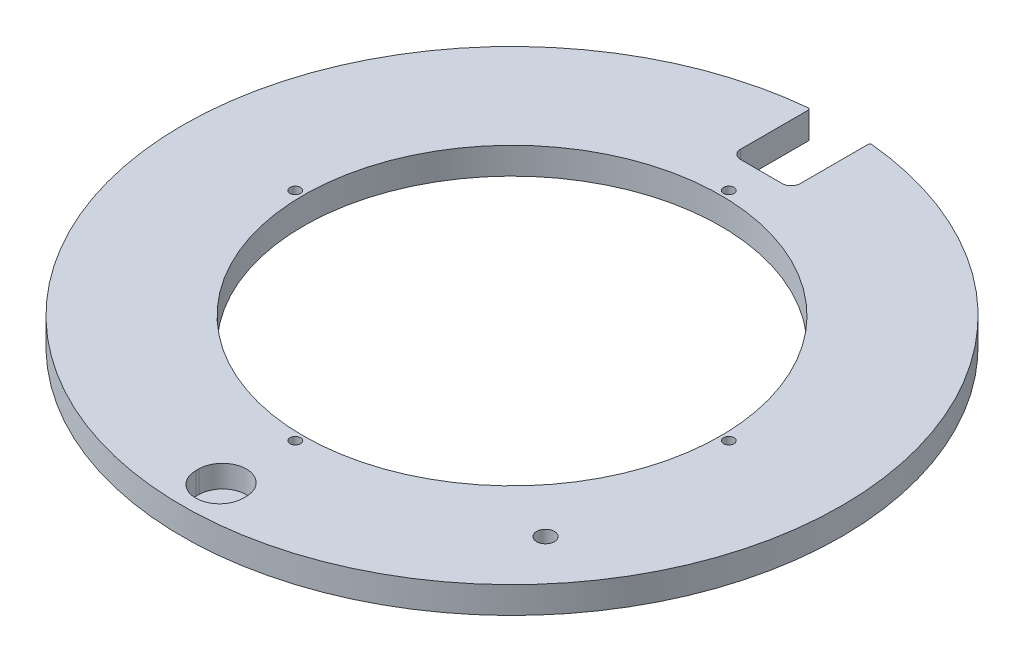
ISO-10303-21;
HEADER;
FILE_DESCRIPTION(('STEP AP214'),'2;1');
FILE_NAME('part.step','',(''),(''),'','','');
FILE_SCHEMA(('AUTOMOTIVE_DESIGN { 1 0 10303 214 1 1 1 1 }'));
ENDSEC;
DATA;
#1=APPLICATION_CONTEXT('core data for automotive mechanical design processes');
#2=APPLICATION_PROTOCOL_DEFINITION('international standard','automotive_design',2000,#1);
#3=PRODUCT_CONTEXT('',#1,'mechanical');
#4=PRODUCT('Part','Part','',(#3));
#5=PRODUCT_RELATED_PRODUCT_CATEGORY('part','',(#4));
#6=PRODUCT_DEFINITION_FORMATION('','',#4);
#7=PRODUCT_DEFINITION_CONTEXT('part definition',#1,'design');
#8=PRODUCT_DEFINITION('design','',#6,#7);
#9=PRODUCT_DEFINITION_SHAPE('','',#8);
#10=(LENGTH_UNIT() NAMED_UNIT(*) SI_UNIT(.MILLI.,.METRE.));
#11=(NAMED_UNIT(*) PLANE_ANGLE_UNIT() SI_UNIT($,.RADIAN.));
#12=(NAMED_UNIT(*) SI_UNIT($,.STERADIAN.) SOLID_ANGLE_UNIT());
#13=UNCERTAINTY_MEASURE_WITH_UNIT(LENGTH_MEASURE(1.E-05),#10,'distance_accuracy_value','');
#14=(GEOMETRIC_REPRESENTATION_CONTEXT(3) GLOBAL_UNCERTAINTY_ASSIGNED_CONTEXT((#13)) GLOBAL_UNIT_ASSIGNED_CONTEXT((#10,
#11,#12)) REPRESENTATION_CONTEXT('',''));
#15=CARTESIAN_POINT('',(0.,0.,0.));
#16=DIRECTION('',(0.,0.,1.));
#17=DIRECTION('',(1.,0.,0.));
#18=AXIS2_PLACEMENT_3D('',#15,#16,#17);
#19=CARTESIAN_POINT('',(0.,1213.64375,0.));
#20=DIRECTION('',(0.,1.,0.));
#21=DIRECTION('',(0.,0.,1.));
#22=AXIS2_PLACEMENT_3D('',#19,#20,#21);
#23=CYLINDRICAL_SURFACE('',#22,176.2125);
#24=CARTESIAN_POINT('',(0.,1204.9125,0.));
#25=DIRECTION('',(0.,1.,0.));
#26=DIRECTION('',(0.,0.,1.));
#27=AXIS2_PLACEMENT_3D('',#24,#25,#26);
#28=CIRCLE('',#27,176.2125);
#29=CARTESIAN_POINT('',(-16.656540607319,1204.9125,-175.423501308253));
#30=VERTEX_POINT('',#29);
#31=CARTESIAN_POINT('',(16.656540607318,1204.9125,-175.423501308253));
#32=VERTEX_POINT('',#31);
#33=EDGE_CURVE('E224',#30,#32,#28,.T.);
#34=ORIENTED_EDGE('',*,*,#33,.T.);
#35=DIRECTION('',(0.,1.,0.));
#36=VECTOR('',#35,1.);
#37=CARTESIAN_POINT('',(16.6565406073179,1213.64375,-175.423501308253));
#38=LINE('',#37,#36);
#39=CARTESIAN_POINT('',(16.6565406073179,1219.2,-175.423501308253));
#40=VERTEX_POINT('',#39);
#41=EDGE_CURVE('E244',#32,#40,#38,.T.);
#42=ORIENTED_EDGE('',*,*,#41,.T.);
#43=CARTESIAN_POINT('',(0.,1219.2,0.));
#44=DIRECTION('',(0.,1.,0.));
#45=DIRECTION('',(0.,0.,1.));
#46=AXIS2_PLACEMENT_3D('',#43,#44,#45);
#47=CIRCLE('',#46,176.2125);
#48=CARTESIAN_POINT('',(-16.6565406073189,1219.2,-175.423501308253));
#49=VERTEX_POINT('',#48);
#50=EDGE_CURVE('E230',#49,#40,#47,.T.);
#51=ORIENTED_EDGE('',*,*,#50,.F.);
#52=DIRECTION('',(0.,1.,0.));
#53=VECTOR('',#52,1.);
#54=CARTESIAN_POINT('',(-16.656540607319,1213.64375,-175.423501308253));
#55=LINE('',#54,#53);
#56=EDGE_CURVE('E241',#49,#30,#55,.F.);
#57=ORIENTED_EDGE('',*,*,#56,.T.);
#58=EDGE_LOOP('',(#34,#42,#51,#57));
#59=FACE_BOUND('',#58,.T.);
#60=ADVANCED_FACE('F32',(#59),#23,.T.);
#61=CARTESIAN_POINT('',(0.,1219.2,0.));
#62=DIRECTION('',(0.,1.,0.));
#63=DIRECTION('',(0.,0.,1.));
#64=AXIS2_PLACEMENT_3D('',#61,#62,#63);
#65=PLANE('',#64);
#66=CARTESIAN_POINT('',(0.,1219.2,0.));
#67=DIRECTION('',(0.,1.,0.));
#68=DIRECTION('',(0.,0.,1.));
#69=AXIS2_PLACEMENT_3D('',#66,#67,#68);
#70=CIRCLE('',#69,111.521875);
#71=CARTESIAN_POINT('',(0.,1219.2,111.521875));
#72=VERTEX_POINT('',#71);
#73=EDGE_CURVE('E227',#72,#72,#70,.T.);
#74=ORIENTED_EDGE('',*,*,#73,.F.);
#75=EDGE_LOOP('',(#74));
#76=FACE_BOUND('',#75,.T.);
#77=CARTESIAN_POINT('',(-5.40415845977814E-13,1219.2,154.78125));
#78=DIRECTION('',(0.,1.,0.));
#79=DIRECTION('',(0.,0.,1.));
#80=AXIS2_PLACEMENT_3D('',#77,#78,#79);
#81=CIRCLE('',#80,12.71905);
#82=CARTESIAN_POINT('',(12.7190499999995,1219.2,154.78125));
#83=VERTEX_POINT('',#82);
#84=CARTESIAN_POINT('',(-12.7190500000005,1219.2,154.78125));
#85=VERTEX_POINT('',#84);
#86=EDGE_CURVE('E189',#83,#85,#81,.T.);
#87=ORIENTED_EDGE('',*,*,#86,.F.);
#88=DIRECTION('',(0.,0.,-1.));
#89=VECTOR('',#88,1.);
#90=CARTESIAN_POINT('',(12.7190499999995,1219.2,154.78125));
#91=LINE('',#90,#89);
#92=CARTESIAN_POINT('',(12.7190499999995,1219.2,156.36875));
#93=VERTEX_POINT('',#92);
#94=EDGE_CURVE('E194',#93,#83,#91,.T.);
#95=ORIENTED_EDGE('',*,*,#94,.F.);
#96=CARTESIAN_POINT('',(-5.45958572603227E-13,1219.2,156.36875));
#97=DIRECTION('',(0.,1.,0.));
#98=DIRECTION('',(0.,0.,1.));
#99=AXIS2_PLACEMENT_3D('',#96,#97,#98);
#100=CIRCLE('',#99,12.71905);
#101=CARTESIAN_POINT('',(-12.7190500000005,1219.2,156.36875));
#102=VERTEX_POINT('',#101);
#103=EDGE_CURVE('E208',#102,#93,#100,.T.);
#104=ORIENTED_EDGE('',*,*,#103,.F.);
#105=DIRECTION('',(0.,0.,1.));
#106=VECTOR('',#105,1.);
#107=CARTESIAN_POINT('',(-12.7190500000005,1219.2,154.78125));
#108=LINE('',#107,#106);
#109=EDGE_CURVE('E205',#85,#102,#108,.T.);
#110=ORIENTED_EDGE('',*,*,#109,.F.);
#111=EDGE_LOOP('',(#87,#95,#104,#110));
#112=FACE_BOUND('',#111,.T.);
#113=CARTESIAN_POINT('',(115.8875,1219.20000000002,0.));
#114=DIRECTION('',(0.,1.,0.));
#115=DIRECTION('',(0.,0.,1.));
#116=AXIS2_PLACEMENT_3D('',#113,#114,#115);
#117=CIRCLE('',#116,2.80670000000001);
#118=CARTESIAN_POINT('',(115.8875,1219.20000000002,2.80670000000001));
#119=VERTEX_POINT('',#118);
#120=EDGE_CURVE('E183',#119,#119,#117,.T.);
#121=ORIENTED_EDGE('',*,*,#120,.F.);
#122=EDGE_LOOP('',(#121));
#123=FACE_BOUND('',#122,.T.);
#124=CARTESIAN_POINT('',(0.,1219.20000000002,115.8875));
#125=DIRECTION('',(0.,1.,0.));
#126=DIRECTION('',(0.,0.,1.));
#127=AXIS2_PLACEMENT_3D('',#124,#125,#126);
#128=CIRCLE('',#127,2.80670000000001);
#129=CARTESIAN_POINT('',(0.,1219.20000000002,118.6942));
#130=VERTEX_POINT('',#129);
#131=EDGE_CURVE('E177',#130,#130,#128,.T.);
#132=ORIENTED_EDGE('',*,*,#131,.F.);
#133=EDGE_LOOP('',(#132));
#134=FACE_BOUND('',#133,.T.);
#135=CARTESIAN_POINT('',(-115.8875,1219.20000000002,0.));
#136=DIRECTION('',(0.,1.,0.));
#137=DIRECTION('',(0.,0.,1.));
#138=AXIS2_PLACEMENT_3D('',#135,#136,#137);
#139=CIRCLE('',#138,2.80670000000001);
#140=CARTESIAN_POINT('',(-115.8875,1219.20000000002,2.80670000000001));
#141=VERTEX_POINT('',#140);
#142=EDGE_CURVE('E171',#141,#141,#139,.T.);
#143=ORIENTED_EDGE('',*,*,#142,.F.);
#144=EDGE_LOOP('',(#143));
#145=FACE_BOUND('',#144,.T.);
#146=CARTESIAN_POINT('',(0.,1219.20000000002,-115.8875));
#147=DIRECTION('',(0.,1.,0.));
#148=DIRECTION('',(0.,0.,1.));
#149=AXIS2_PLACEMENT_3D('',#146,#147,#148);
#150=CIRCLE('',#149,2.80670000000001);
#151=CARTESIAN_POINT('',(0.,1219.20000000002,-113.0808));
#152=VERTEX_POINT('',#151);
#153=EDGE_CURVE('E165',#152,#152,#150,.T.);
#154=ORIENTED_EDGE('',*,*,#153,.F.);
#155=EDGE_LOOP('',(#154));
#156=FACE_BOUND('',#155,.T.);
#157=CARTESIAN_POINT('',(111.272743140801,1219.2,93.3689177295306));
#158=DIRECTION('',(0.,1.,0.));
#159=DIRECTION('',(0.,0.,1.));
#160=AXIS2_PLACEMENT_3D('',#157,#158,#159);
#161=CIRCLE('',#160,4.76885000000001);
#162=CARTESIAN_POINT('',(111.272743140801,1219.2,98.1377677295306));
#163=VERTEX_POINT('',#162);
#164=EDGE_CURVE('E162',#163,#163,#161,.T.);
#165=ORIENTED_EDGE('',*,*,#164,.F.);
#166=EDGE_LOOP('',(#165));
#167=FACE_BOUND('',#166,.T.);
#168=ORIENTED_EDGE('',*,*,#50,.T.);
#169=DIRECTION('',(0.708710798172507,0.,-0.705499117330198));
#170=VECTOR('',#169,1.);
#171=CARTESIAN_POINT('',(-79.4204025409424,1219.2,-79.7819522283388));
#172=LINE('',#171,#170);
#173=CARTESIAN_POINT('',(15.9257999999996,1219.20000000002,-174.696072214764));
#174=VERTEX_POINT('',#173);
#175=EDGE_CURVE('E249',#40,#174,#172,.F.);
#176=ORIENTED_EDGE('',*,*,#175,.T.);
#177=DIRECTION('',(0.,0.,-1.));
#178=VECTOR('',#177,1.);
#179=CARTESIAN_POINT('',(15.9257999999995,1219.20000000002,-184.15));
#180=LINE('',#179,#178);
#181=CARTESIAN_POINT('',(15.9258,1219.20000000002,-138.1125));
#182=VERTEX_POINT('',#181);
#183=EDGE_CURVE('E151',#182,#174,#180,.T.);
#184=ORIENTED_EDGE('',*,*,#183,.F.);
#185=CARTESIAN_POINT('',(11.1633,1219.20000000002,-138.1125));
#186=DIRECTION('',(0.,1.,0.));
#187=DIRECTION('',(0.,0.,-1.));
#188=AXIS2_PLACEMENT_3D('',#185,#186,#187);
#189=CIRCLE('',#188,4.7625);
#190=CARTESIAN_POINT('',(11.1633,1219.20000000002,-133.35));
#191=VERTEX_POINT('',#190);
#192=EDGE_CURVE('E147',#191,#182,#189,.T.);
#193=ORIENTED_EDGE('',*,*,#192,.F.);
#194=DIRECTION('',(1.,0.,0.));
#195=VECTOR('',#194,1.);
#196=CARTESIAN_POINT('',(-11.1633000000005,1219.20000000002,-133.35));
#197=LINE('',#196,#195);
#198=CARTESIAN_POINT('',(-11.1633000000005,1219.20000000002,-133.35));
#199=VERTEX_POINT('',#198);
#200=EDGE_CURVE('E145',#199,#191,#197,.T.);
#201=ORIENTED_EDGE('',*,*,#200,.F.);
#202=CARTESIAN_POINT('',(-11.1633,1219.20000000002,-138.1125));
#203=DIRECTION('',(0.,1.,0.));
#204=DIRECTION('',(0.,0.,-1.));
#205=AXIS2_PLACEMENT_3D('',#202,#203,#204);
#206=CIRCLE('',#205,4.76250000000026);
#207=CARTESIAN_POINT('',(-15.9258000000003,1219.20000000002,-138.1125));
#208=VERTEX_POINT('',#207);
#209=EDGE_CURVE('E130',#208,#199,#206,.T.);
#210=ORIENTED_EDGE('',*,*,#209,.F.);
#211=DIRECTION('',(0.,0.,1.));
#212=VECTOR('',#211,1.);
#213=CARTESIAN_POINT('',(-15.9258000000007,1219.20000000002,-184.15));
#214=LINE('',#213,#212);
#215=CARTESIAN_POINT('',(-15.9258000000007,1219.20000000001,-174.696072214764));
#216=VERTEX_POINT('',#215);
#217=EDGE_CURVE('E122',#216,#208,#214,.T.);
#218=ORIENTED_EDGE('',*,*,#217,.F.);
#219=DIRECTION('',(-0.708710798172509,0.,-0.705499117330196));
#220=VECTOR('',#219,1.);
#221=CARTESIAN_POINT('',(79.4204025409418,1219.2,-79.7819522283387));
#222=LINE('',#221,#220);
#223=EDGE_CURVE('E247',#216,#49,#222,.T.);
#224=ORIENTED_EDGE('',*,*,#223,.T.);
#225=EDGE_LOOP('',(#168,#176,#184,#193,#201,#210,#218,#224));
#226=FACE_BOUND('',#225,.T.);
#227=ADVANCED_FACE('F143',(#76,#112,#123,#134,#145,#156,#167,#226),#65,.T.);
#228=CARTESIAN_POINT('',(0.,1204.9125,0.));
#229=DIRECTION('',(0.,1.,0.));
#230=DIRECTION('',(0.,0.,1.));
#231=AXIS2_PLACEMENT_3D('',#228,#229,#230);
#232=PLANE('',#231);
#233=CARTESIAN_POINT('',(0.,1204.9125,0.));
#234=DIRECTION('',(0.,1.,0.));
#235=DIRECTION('',(0.,0.,1.));
#236=AXIS2_PLACEMENT_3D('',#233,#234,#235);
#237=CIRCLE('',#236,111.521875);
#238=CARTESIAN_POINT('',(0.,1204.9125,111.521875));
#239=VERTEX_POINT('',#238);
#240=EDGE_CURVE('E215',#239,#239,#237,.T.);
#241=ORIENTED_EDGE('',*,*,#240,.T.);
#242=EDGE_LOOP('',(#241));
#243=FACE_BOUND('',#242,.T.);
#244=CARTESIAN_POINT('',(115.8875,1204.9125,0.));
#245=DIRECTION('',(0.,1.,0.));
#246=DIRECTION('',(0.,0.,1.));
#247=AXIS2_PLACEMENT_3D('',#244,#245,#246);
#248=CIRCLE('',#247,2.8067);
#249=CARTESIAN_POINT('',(115.8875,1204.9125,2.80670000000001));
#250=VERTEX_POINT('',#249);
#251=EDGE_CURVE('E186',#250,#250,#248,.T.);
#252=ORIENTED_EDGE('',*,*,#251,.T.);
#253=EDGE_LOOP('',(#252));
#254=FACE_BOUND('',#253,.T.);
#255=CARTESIAN_POINT('',(0.,1204.9125,115.8875));
#256=DIRECTION('',(0.,1.,0.));
#257=DIRECTION('',(0.,0.,1.));
#258=AXIS2_PLACEMENT_3D('',#255,#256,#257);
#259=CIRCLE('',#258,2.8067);
#260=CARTESIAN_POINT('',(0.,1204.9125,118.6942));
#261=VERTEX_POINT('',#260);
#262=EDGE_CURVE('E180',#261,#261,#259,.T.);
#263=ORIENTED_EDGE('',*,*,#262,.T.);
#264=EDGE_LOOP('',(#263));
#265=FACE_BOUND('',#264,.T.);
#266=CARTESIAN_POINT('',(-115.8875,1204.9125,0.));
#267=DIRECTION('',(0.,1.,0.));
#268=DIRECTION('',(0.,0.,1.));
#269=AXIS2_PLACEMENT_3D('',#266,#267,#268);
#270=CIRCLE('',#269,2.8067);
#271=CARTESIAN_POINT('',(-115.8875,1204.9125,2.8067));
#272=VERTEX_POINT('',#271);
#273=EDGE_CURVE('E174',#272,#272,#270,.T.);
#274=ORIENTED_EDGE('',*,*,#273,.T.);
#275=EDGE_LOOP('',(#274));
#276=FACE_BOUND('',#275,.T.);
#277=CARTESIAN_POINT('',(0.,1204.9125,-115.8875));
#278=DIRECTION('',(0.,1.,0.));
#279=DIRECTION('',(0.,0.,1.));
#280=AXIS2_PLACEMENT_3D('',#277,#278,#279);
#281=CIRCLE('',#280,2.8067);
#282=CARTESIAN_POINT('',(0.,1204.9125,-113.0808));
#283=VERTEX_POINT('',#282);
#284=EDGE_CURVE('E168',#283,#283,#281,.T.);
#285=ORIENTED_EDGE('',*,*,#284,.T.);
#286=EDGE_LOOP('',(#285));
#287=FACE_BOUND('',#286,.T.);
#288=CARTESIAN_POINT('',(111.272743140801,1204.91249999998,93.3689177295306));
#289=DIRECTION('',(0.,-1.,0.));
#290=DIRECTION('',(0.,0.,-1.));
#291=AXIS2_PLACEMENT_3D('',#288,#289,#290);
#292=CIRCLE('',#291,4.76885000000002);
#293=CARTESIAN_POINT('',(111.272743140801,1204.91249999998,88.6000677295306));
#294=VERTEX_POINT('',#293);
#295=EDGE_CURVE('E138',#294,#294,#292,.T.);
#296=ORIENTED_EDGE('',*,*,#295,.F.);
#297=EDGE_LOOP('',(#296));
#298=FACE_BOUND('',#297,.T.);
#299=DIRECTION('',(0.,0.,1.));
#300=VECTOR('',#299,1.);
#301=CARTESIAN_POINT('',(15.9258000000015,1204.9125,-1.69226701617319E-13));
#302=LINE('',#301,#300);
#303=CARTESIAN_POINT('',(15.9257999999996,1204.9125,-174.696072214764));
#304=VERTEX_POINT('',#303);
#305=CARTESIAN_POINT('',(15.9258,1204.9125,-138.1125));
#306=VERTEX_POINT('',#305);
#307=EDGE_CURVE('E232',#304,#306,#302,.T.);
#308=ORIENTED_EDGE('',*,*,#307,.F.);
#309=DIRECTION('',(-0.708710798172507,0.,0.705499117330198));
#310=VECTOR('',#309,1.);
#311=CARTESIAN_POINT('',(16.6565406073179,1204.9125,-175.423501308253));
#312=LINE('',#311,#310);
#313=EDGE_CURVE('E40',#304,#32,#312,.F.);
#314=ORIENTED_EDGE('',*,*,#313,.T.);
#315=ORIENTED_EDGE('',*,*,#33,.F.);
#316=DIRECTION('',(0.708710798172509,0.,0.705499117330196));
#317=VECTOR('',#316,1.);
#318=CARTESIAN_POINT('',(-16.656540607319,1204.9125,-175.423501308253));
#319=LINE('',#318,#317);
#320=CARTESIAN_POINT('',(-15.9258000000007,1204.9125,-174.696072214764));
#321=VERTEX_POINT('',#320);
#322=EDGE_CURVE('E47',#30,#321,#319,.T.);
#323=ORIENTED_EDGE('',*,*,#322,.T.);
#324=DIRECTION('',(0.,0.,-1.));
#325=VECTOR('',#324,1.);
#326=CARTESIAN_POINT('',(-15.9258,1204.9125,0.));
#327=LINE('',#326,#325);
#328=CARTESIAN_POINT('',(-15.9258000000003,1204.9125,-138.1125));
#329=VERTEX_POINT('',#328);
#330=EDGE_CURVE('E239',#329,#321,#327,.T.);
#331=ORIENTED_EDGE('',*,*,#330,.F.);
#332=CARTESIAN_POINT('',(-11.1633,1204.9125,-138.1125));
#333=DIRECTION('',(0.,1.,0.));
#334=DIRECTION('',(0.,0.,1.));
#335=AXIS2_PLACEMENT_3D('',#332,#333,#334);
#336=CIRCLE('',#335,4.76250000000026);
#337=CARTESIAN_POINT('',(-11.1633000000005,1204.9125,-133.35));
#338=VERTEX_POINT('',#337);
#339=EDGE_CURVE('E137',#338,#329,#336,.F.);
#340=ORIENTED_EDGE('',*,*,#339,.F.);
#341=DIRECTION('',(-1.,0.,0.));
#342=VECTOR('',#341,1.);
#343=CARTESIAN_POINT('',(0.,1204.9125,-133.35));
#344=LINE('',#343,#342);
#345=CARTESIAN_POINT('',(11.1633,1204.9125,-133.35));
#346=VERTEX_POINT('',#345);
#347=EDGE_CURVE('E236',#346,#338,#344,.T.);
#348=ORIENTED_EDGE('',*,*,#347,.F.);
#349=CARTESIAN_POINT('',(11.1633,1204.9125,-138.1125));
#350=DIRECTION('',(0.,1.,0.));
#351=DIRECTION('',(0.,0.,1.));
#352=AXIS2_PLACEMENT_3D('',#349,#350,#351);
#353=CIRCLE('',#352,4.7625);
#354=EDGE_CURVE('E234',#306,#346,#353,.F.);
#355=ORIENTED_EDGE('',*,*,#354,.F.);
#356=EDGE_LOOP('',(#308,#314,#315,#323,#331,#340,#348,#355));
#357=FACE_BOUND('',#356,.T.);
#358=ADVANCED_FACE('F253',(#243,#254,#265,#276,#287,#298,#357),#232,.F.);
#359=CARTESIAN_POINT('',(0.,1213.64375,0.));
#360=DIRECTION('',(0.,1.,0.));
#361=DIRECTION('',(0.,0.,1.));
#362=AXIS2_PLACEMENT_3D('',#359,#360,#361);
#363=CYLINDRICAL_SURFACE('',#362,111.521875);
#364=ORIENTED_EDGE('',*,*,#73,.T.);
#365=EDGE_LOOP('',(#364));
#366=FACE_BOUND('',#365,.T.);
#367=ORIENTED_EDGE('',*,*,#240,.F.);
#368=EDGE_LOOP('',(#367));
#369=FACE_BOUND('',#368,.T.);
#370=ADVANCED_FACE('F339',(#366,#369),#363,.F.);
#371=CARTESIAN_POINT('',(-5.40415845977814E-13,1207.29375,154.78125));
#372=DIRECTION('',(0.,1.,0.));
#373=DIRECTION('',(0.,0.,1.));
#374=AXIS2_PLACEMENT_3D('',#371,#372,#373);
#375=CYLINDRICAL_SURFACE('',#374,12.71905);
#376=ORIENTED_EDGE('',*,*,#86,.T.);
#377=DIRECTION('',(0.,1.,0.));
#378=VECTOR('',#377,1.);
#379=CARTESIAN_POINT('',(-12.7190500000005,1207.29375,154.78125));
#380=LINE('',#379,#378);
#381=CARTESIAN_POINT('',(-12.7190500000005,1207.29375,154.78125));
#382=VERTEX_POINT('',#381);
#383=EDGE_CURVE('E203',#382,#85,#380,.T.);
#384=ORIENTED_EDGE('',*,*,#383,.F.);
#385=CARTESIAN_POINT('',(-5.40415845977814E-13,1207.29375,154.78125));
#386=DIRECTION('',(0.,1.,0.));
#387=DIRECTION('',(0.,0.,1.));
#388=AXIS2_PLACEMENT_3D('',#385,#386,#387);
#389=CIRCLE('',#388,12.71905);
#390=CARTESIAN_POINT('',(12.7190499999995,1207.29375,154.78125));
#391=VERTEX_POINT('',#390);
#392=EDGE_CURVE('E190',#391,#382,#389,.T.);
#393=ORIENTED_EDGE('',*,*,#392,.F.);
#394=DIRECTION('',(0.,1.,0.));
#395=VECTOR('',#394,1.);
#396=CARTESIAN_POINT('',(12.7190499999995,1207.29375,154.78125));
#397=LINE('',#396,#395);
#398=EDGE_CURVE('E213',#391,#83,#397,.T.);
#399=ORIENTED_EDGE('',*,*,#398,.T.);
#400=EDGE_LOOP('',(#376,#384,#393,#399));
#401=FACE_BOUND('',#400,.T.);
#402=ADVANCED_FACE('F329',(#401),#375,.F.);
#403=CARTESIAN_POINT('',(12.7190499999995,1207.29375,154.78125));
#404=DIRECTION('',(1.,0.,0.));
#405=DIRECTION('',(0.,0.,-1.));
#406=AXIS2_PLACEMENT_3D('',#403,#404,#405);
#407=PLANE('',#406);
#408=ORIENTED_EDGE('',*,*,#94,.T.);
#409=ORIENTED_EDGE('',*,*,#398,.F.);
#410=DIRECTION('',(0.,0.,-1.));
#411=VECTOR('',#410,1.);
#412=CARTESIAN_POINT('',(12.7190499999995,1207.29375,154.78125));
#413=LINE('',#412,#411);
#414=CARTESIAN_POINT('',(12.7190499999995,1207.29375,156.36875));
#415=VERTEX_POINT('',#414);
#416=EDGE_CURVE('E200',#415,#391,#413,.T.);
#417=ORIENTED_EDGE('',*,*,#416,.F.);
#418=DIRECTION('',(0.,1.,0.));
#419=VECTOR('',#418,1.);
#420=CARTESIAN_POINT('',(12.7190499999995,1207.29375,156.36875));
#421=LINE('',#420,#419);
#422=EDGE_CURVE('E216',#415,#93,#421,.T.);
#423=ORIENTED_EDGE('',*,*,#422,.T.);
#424=EDGE_LOOP('',(#408,#409,#417,#423));
#425=FACE_BOUND('',#424,.T.);
#426=ADVANCED_FACE('F325',(#425),#407,.F.);
#427=CARTESIAN_POINT('',(-5.45958572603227E-13,1207.29375,156.36875));
#428=DIRECTION('',(0.,1.,0.));
#429=DIRECTION('',(0.,0.,1.));
#430=AXIS2_PLACEMENT_3D('',#427,#428,#429);
#431=CYLINDRICAL_SURFACE('',#430,12.71905);
#432=ORIENTED_EDGE('',*,*,#103,.T.);
#433=ORIENTED_EDGE('',*,*,#422,.F.);
#434=CARTESIAN_POINT('',(-5.45958572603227E-13,1207.29375,156.36875));
#435=DIRECTION('',(0.,1.,0.));
#436=DIRECTION('',(0.,0.,1.));
#437=AXIS2_PLACEMENT_3D('',#434,#435,#436);
#438=CIRCLE('',#437,12.71905);
#439=CARTESIAN_POINT('',(-12.7190500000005,1207.29375,156.36875));
#440=VERTEX_POINT('',#439);
#441=EDGE_CURVE('E197',#440,#415,#438,.T.);
#442=ORIENTED_EDGE('',*,*,#441,.F.);
#443=DIRECTION('',(0.,1.,0.));
#444=VECTOR('',#443,1.);
#445=CARTESIAN_POINT('',(-12.7190500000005,1207.29375,156.36875));
#446=LINE('',#445,#444);
#447=EDGE_CURVE('E218',#440,#102,#446,.T.);
#448=ORIENTED_EDGE('',*,*,#447,.T.);
#449=EDGE_LOOP('',(#432,#433,#442,#448));
#450=FACE_BOUND('',#449,.T.);
#451=ADVANCED_FACE('F328',(#450),#431,.F.);
#452=CARTESIAN_POINT('',(-12.7190500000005,1207.29375,154.78125));
#453=DIRECTION('',(-1.,0.,0.));
#454=DIRECTION('',(0.,0.,1.));
#455=AXIS2_PLACEMENT_3D('',#452,#453,#454);
#456=PLANE('',#455);
#457=ORIENTED_EDGE('',*,*,#109,.T.);
#458=ORIENTED_EDGE('',*,*,#447,.F.);
#459=DIRECTION('',(0.,0.,1.));
#460=VECTOR('',#459,1.);
#461=CARTESIAN_POINT('',(-12.7190500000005,1207.29375,154.78125));
#462=LINE('',#461,#460);
#463=EDGE_CURVE('E193',#382,#440,#462,.T.);
#464=ORIENTED_EDGE('',*,*,#463,.F.);
#465=ORIENTED_EDGE('',*,*,#383,.T.);
#466=EDGE_LOOP('',(#457,#458,#464,#465));
#467=FACE_BOUND('',#466,.T.);
#468=ADVANCED_FACE('F323',(#467),#456,.F.);
#469=CARTESIAN_POINT('',(-5.40415845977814E-13,1207.29375,154.78125));
#470=DIRECTION('',(0.,1.,0.));
#471=DIRECTION('',(0.,0.,1.));
#472=AXIS2_PLACEMENT_3D('',#469,#470,#471);
#473=PLANE('',#472);
#474=ORIENTED_EDGE('',*,*,#392,.T.);
#475=ORIENTED_EDGE('',*,*,#463,.T.);
#476=ORIENTED_EDGE('',*,*,#441,.T.);
#477=ORIENTED_EDGE('',*,*,#416,.T.);
#478=EDGE_LOOP('',(#474,#475,#476,#477));
#479=FACE_BOUND('',#478,.T.);
#480=ADVANCED_FACE('F319',(#479),#473,.T.);
#481=CARTESIAN_POINT('',(115.8875,1219.20000000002,0.));
#482=DIRECTION('',(0.,1.,0.));
#483=DIRECTION('',(0.,0.,1.));
#484=AXIS2_PLACEMENT_3D('',#481,#482,#483);
#485=CYLINDRICAL_SURFACE('',#484,2.8067);
#486=ORIENTED_EDGE('',*,*,#120,.T.);
#487=EDGE_LOOP('',(#486));
#488=FACE_BOUND('',#487,.T.);
#489=ORIENTED_EDGE('',*,*,#251,.F.);
#490=EDGE_LOOP('',(#489));
#491=FACE_BOUND('',#490,.T.);
#492=ADVANCED_FACE('F315',(#488,#491),#485,.F.);
#493=CARTESIAN_POINT('',(0.,1219.20000000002,115.8875));
#494=DIRECTION('',(0.,1.,0.));
#495=DIRECTION('',(0.,0.,1.));
#496=AXIS2_PLACEMENT_3D('',#493,#494,#495);
#497=CYLINDRICAL_SURFACE('',#496,2.8067);
#498=ORIENTED_EDGE('',*,*,#131,.T.);
#499=EDGE_LOOP('',(#498));
#500=FACE_BOUND('',#499,.T.);
#501=ORIENTED_EDGE('',*,*,#262,.F.);
#502=EDGE_LOOP('',(#501));
#503=FACE_BOUND('',#502,.T.);
#504=ADVANCED_FACE('F311',(#500,#503),#497,.F.);
#505=CARTESIAN_POINT('',(-115.8875,1219.20000000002,0.));
#506=DIRECTION('',(0.,1.,0.));
#507=DIRECTION('',(0.,0.,1.));
#508=AXIS2_PLACEMENT_3D('',#505,#506,#507);
#509=CYLINDRICAL_SURFACE('',#508,2.8067);
#510=ORIENTED_EDGE('',*,*,#142,.T.);
#511=EDGE_LOOP('',(#510));
#512=FACE_BOUND('',#511,.T.);
#513=ORIENTED_EDGE('',*,*,#273,.F.);
#514=EDGE_LOOP('',(#513));
#515=FACE_BOUND('',#514,.T.);
#516=ADVANCED_FACE('F307',(#512,#515),#509,.F.);
#517=CARTESIAN_POINT('',(0.,1219.20000000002,-115.8875));
#518=DIRECTION('',(0.,1.,0.));
#519=DIRECTION('',(0.,0.,1.));
#520=AXIS2_PLACEMENT_3D('',#517,#518,#519);
#521=CYLINDRICAL_SURFACE('',#520,2.8067);
#522=ORIENTED_EDGE('',*,*,#153,.T.);
#523=EDGE_LOOP('',(#522));
#524=FACE_BOUND('',#523,.T.);
#525=ORIENTED_EDGE('',*,*,#284,.F.);
#526=EDGE_LOOP('',(#525));
#527=FACE_BOUND('',#526,.T.);
#528=ADVANCED_FACE('F303',(#524,#527),#521,.F.);
#529=CARTESIAN_POINT('',(111.272743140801,1204.91249999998,93.3689177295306));
#530=DIRECTION('',(0.,-1.,0.));
#531=DIRECTION('',(0.,0.,-1.));
#532=AXIS2_PLACEMENT_3D('',#529,#530,#531);
#533=CYLINDRICAL_SURFACE('',#532,4.76885000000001);
#534=ORIENTED_EDGE('',*,*,#164,.T.);
#535=EDGE_LOOP('',(#534));
#536=FACE_BOUND('',#535,.T.);
#537=ORIENTED_EDGE('',*,*,#295,.T.);
#538=EDGE_LOOP('',(#537));
#539=FACE_BOUND('',#538,.T.);
#540=ADVANCED_FACE('F277',(#536,#539),#533,.F.);
#541=CARTESIAN_POINT('',(-11.1633,1219.20000000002,-138.1125));
#542=DIRECTION('',(0.,-1.,0.));
#543=DIRECTION('',(0.,0.,-1.));
#544=AXIS2_PLACEMENT_3D('',#541,#542,#543);
#545=CYLINDRICAL_SURFACE('',#544,4.76250000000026);
#546=ORIENTED_EDGE('',*,*,#339,.T.);
#547=DIRECTION('',(0.,-1.,0.));
#548=VECTOR('',#547,1.);
#549=CARTESIAN_POINT('',(-15.9258000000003,1219.20000000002,-138.1125));
#550=LINE('',#549,#548);
#551=EDGE_CURVE('E125',#208,#329,#550,.T.);
#552=ORIENTED_EDGE('',*,*,#551,.F.);
#553=ORIENTED_EDGE('',*,*,#209,.T.);
#554=DIRECTION('',(0.,-1.,0.));
#555=VECTOR('',#554,1.);
#556=CARTESIAN_POINT('',(-11.1633000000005,1219.20000000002,-133.35));
#557=LINE('',#556,#555);
#558=EDGE_CURVE('E139',#199,#338,#557,.T.);
#559=ORIENTED_EDGE('',*,*,#558,.T.);
#560=EDGE_LOOP('',(#546,#552,#553,#559));
#561=FACE_BOUND('',#560,.T.);
#562=ADVANCED_FACE('F133',(#561),#545,.F.);
#563=CARTESIAN_POINT('',(-11.1633000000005,1219.20000000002,-133.35));
#564=DIRECTION('',(0.,0.,-1.));
#565=DIRECTION('',(-1.,0.,0.));
#566=AXIS2_PLACEMENT_3D('',#563,#564,#565);
#567=PLANE('',#566);
#568=ORIENTED_EDGE('',*,*,#347,.T.);
#569=ORIENTED_EDGE('',*,*,#558,.F.);
#570=ORIENTED_EDGE('',*,*,#200,.T.);
#571=DIRECTION('',(0.,-1.,0.));
#572=VECTOR('',#571,1.);
#573=CARTESIAN_POINT('',(11.1633,1219.20000000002,-133.35));
#574=LINE('',#573,#572);
#575=EDGE_CURVE('E156',#191,#346,#574,.T.);
#576=ORIENTED_EDGE('',*,*,#575,.T.);
#577=EDGE_LOOP('',(#568,#569,#570,#576));
#578=FACE_BOUND('',#577,.T.);
#579=ADVANCED_FACE('F269',(#578),#567,.T.);
#580=CARTESIAN_POINT('',(11.1633,1219.20000000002,-138.1125));
#581=DIRECTION('',(0.,-1.,0.));
#582=DIRECTION('',(0.,0.,-1.));
#583=AXIS2_PLACEMENT_3D('',#580,#581,#582);
#584=CYLINDRICAL_SURFACE('',#583,4.7625);
#585=ORIENTED_EDGE('',*,*,#354,.T.);
#586=ORIENTED_EDGE('',*,*,#575,.F.);
#587=ORIENTED_EDGE('',*,*,#192,.T.);
#588=DIRECTION('',(0.,-1.,0.));
#589=VECTOR('',#588,1.);
#590=CARTESIAN_POINT('',(15.9258,1219.20000000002,-138.1125));
#591=LINE('',#590,#589);
#592=EDGE_CURVE('E153',#182,#306,#591,.T.);
#593=ORIENTED_EDGE('',*,*,#592,.T.);
#594=EDGE_LOOP('',(#585,#586,#587,#593));
#595=FACE_BOUND('',#594,.T.);
#596=ADVANCED_FACE('F265',(#595),#584,.F.);
#597=CARTESIAN_POINT('',(-15.9258000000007,1219.20000000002,-184.15));
#598=DIRECTION('',(1.,0.,0.));
#599=DIRECTION('',(0.,0.,-1.));
#600=AXIS2_PLACEMENT_3D('',#597,#598,#599);
#601=PLANE('',#600);
#602=ORIENTED_EDGE('',*,*,#330,.T.);
#603=DIRECTION('',(0.,1.,0.));
#604=VECTOR('',#603,1.);
#605=CARTESIAN_POINT('',(-15.9258000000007,1219.20000000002,-174.696072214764));
#606=LINE('',#605,#604);
#607=EDGE_CURVE('E11',#321,#216,#606,.T.);
#608=ORIENTED_EDGE('',*,*,#607,.T.);
#609=ORIENTED_EDGE('',*,*,#217,.T.);
#610=ORIENTED_EDGE('',*,*,#551,.T.);
#611=EDGE_LOOP('',(#602,#608,#609,#610));
#612=FACE_BOUND('',#611,.T.);
#613=ADVANCED_FACE('F124',(#612),#601,.T.);
#614=CARTESIAN_POINT('',(15.9257999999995,1219.20000000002,-184.15));
#615=DIRECTION('',(-1.,0.,0.));
#616=DIRECTION('',(0.,0.,1.));
#617=AXIS2_PLACEMENT_3D('',#614,#615,#616);
#618=PLANE('',#617);
#619=ORIENTED_EDGE('',*,*,#183,.T.);
#620=DIRECTION('',(0.,-1.,0.));
#621=VECTOR('',#620,1.);
#622=CARTESIAN_POINT('',(15.9257999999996,1219.20000000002,-174.696072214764));
#623=LINE('',#622,#621);
#624=EDGE_CURVE('E55',#174,#304,#623,.T.);
#625=ORIENTED_EDGE('',*,*,#624,.T.);
#626=ORIENTED_EDGE('',*,*,#307,.T.);
#627=ORIENTED_EDGE('',*,*,#592,.F.);
#628=EDGE_LOOP('',(#619,#625,#626,#627));
#629=FACE_BOUND('',#628,.T.);
#630=ADVANCED_FACE('F263',(#629),#618,.T.);
#631=CARTESIAN_POINT('',(16.6565406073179,1213.64375,-175.423501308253));
#632=DIRECTION('',(0.705499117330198,0.,0.708710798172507));
#633=DIRECTION('',(0.708710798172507,0.,-0.705499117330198));
#634=AXIS2_PLACEMENT_3D('',#631,#632,#633);
#635=PLANE('',#634);
#636=ORIENTED_EDGE('',*,*,#313,.F.);
#637=ORIENTED_EDGE('',*,*,#624,.F.);
#638=ORIENTED_EDGE('',*,*,#175,.F.);
#639=ORIENTED_EDGE('',*,*,#41,.F.);
#640=EDGE_LOOP('',(#636,#637,#638,#639));
#641=FACE_BOUND('',#640,.T.);
#642=ADVANCED_FACE('F260',(#641),#635,.F.);
#643=CARTESIAN_POINT('',(-16.656540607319,1213.64375,-175.423501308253));
#644=DIRECTION('',(0.705499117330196,0.,-0.708710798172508));
#645=DIRECTION('',(-0.708710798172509,0.,-0.705499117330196));
#646=AXIS2_PLACEMENT_3D('',#643,#644,#645);
#647=PLANE('',#646);
#648=ORIENTED_EDGE('',*,*,#223,.F.);
#649=ORIENTED_EDGE('',*,*,#607,.F.);
#650=ORIENTED_EDGE('',*,*,#322,.F.);
#651=ORIENTED_EDGE('',*,*,#56,.F.);
#652=EDGE_LOOP('',(#648,#649,#650,#651));
#653=FACE_BOUND('',#652,.T.);
#654=ADVANCED_FACE('F34',(#653),#647,.T.);
#655=CLOSED_SHELL('',(#60,#227,#358,#370,#402,#426,#451,#468,#480,#492,#504,#516,#528,#540,#562,
#579,#596,#613,#630,#642,#654));
#656=MANIFOLD_SOLID_BREP('B2',#655);
#657=ADVANCED_BREP_SHAPE_REPRESENTATION('',(#18,#656),#14);
#658=SHAPE_DEFINITION_REPRESENTATION(#9,#657);
ENDSEC;
END-ISO-10303-21;
